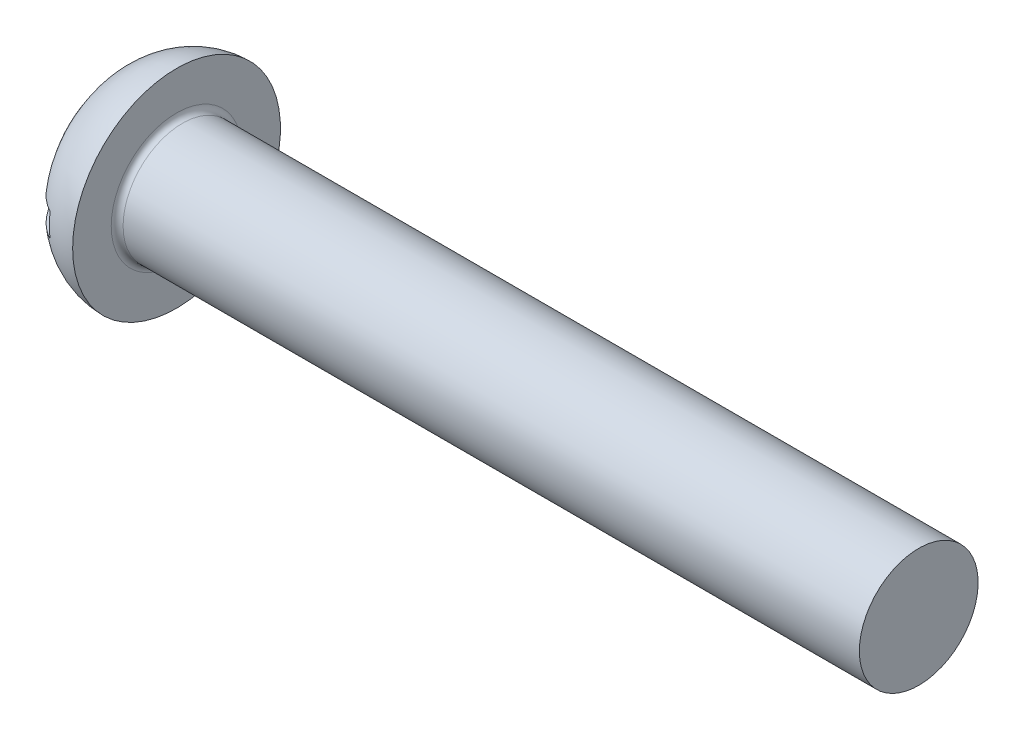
ISO-10303-21;
HEADER;
FILE_DESCRIPTION(('STEP AP214'),'2;1');
FILE_NAME('part.step','',(''),(''),'','','');
FILE_SCHEMA(('AUTOMOTIVE_DESIGN { 1 0 10303 214 1 1 1 1 }'));
ENDSEC;
DATA;
#1=APPLICATION_CONTEXT('core data for automotive mechanical design processes');
#2=APPLICATION_PROTOCOL_DEFINITION('international standard','automotive_design',2000,#1);
#3=PRODUCT_CONTEXT('',#1,'mechanical');
#4=PRODUCT('Part','Part','',(#3));
#5=PRODUCT_RELATED_PRODUCT_CATEGORY('part','',(#4));
#6=PRODUCT_DEFINITION_FORMATION('','',#4);
#7=PRODUCT_DEFINITION_CONTEXT('part definition',#1,'design');
#8=PRODUCT_DEFINITION('design','',#6,#7);
#9=PRODUCT_DEFINITION_SHAPE('','',#8);
#10=(LENGTH_UNIT() NAMED_UNIT(*) SI_UNIT(.MILLI.,.METRE.));
#11=(NAMED_UNIT(*) PLANE_ANGLE_UNIT() SI_UNIT($,.RADIAN.));
#12=(NAMED_UNIT(*) SI_UNIT($,.STERADIAN.) SOLID_ANGLE_UNIT());
#13=UNCERTAINTY_MEASURE_WITH_UNIT(LENGTH_MEASURE(1.E-05),#10,'distance_accuracy_value','');
#14=(GEOMETRIC_REPRESENTATION_CONTEXT(3) GLOBAL_UNCERTAINTY_ASSIGNED_CONTEXT((#13)) GLOBAL_UNIT_ASSIGNED_CONTEXT((#10,
#11,#12)) REPRESENTATION_CONTEXT('',''));
#15=CARTESIAN_POINT('',(0.,0.,0.));
#16=DIRECTION('',(0.,0.,1.));
#17=DIRECTION('',(1.,0.,0.));
#18=AXIS2_PLACEMENT_3D('',#15,#16,#17);
#19=CARTESIAN_POINT('',(8.4,0.,0.));
#20=DIRECTION('',(-1.,0.,0.));
#21=DIRECTION('',(0.,1.,0.));
#22=AXIS2_PLACEMENT_3D('',#19,#20,#21);
#23=SPHERICAL_SURFACE('',#22,8.4);
#24=CARTESIAN_POINT('',(8.4,0.8,0.));
#25=DIRECTION('',(0.,-1.,0.));
#26=DIRECTION('',(0.,0.,-1.));
#27=AXIS2_PLACEMENT_3D('',#24,#25,#26);
#28=CIRCLE('',#27,8.36181798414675);
#29=CARTESIAN_POINT('',(1.88795521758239,0.799999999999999,5.24530959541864));
#30=VERTEX_POINT('',#29);
#31=CARTESIAN_POINT('',(1.88795521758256,0.800000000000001,-5.24530959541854));
#32=VERTEX_POINT('',#31);
#33=EDGE_CURVE('E61',#30,#32,#28,.T.);
#34=ORIENTED_EDGE('',*,*,#33,.F.);
#35=CARTESIAN_POINT('',(1.88795521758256,0.,0.));
#36=DIRECTION('',(-1.,0.,0.));
#37=DIRECTION('',(0.,0.,1.));
#38=AXIS2_PLACEMENT_3D('',#35,#36,#37);
#39=CIRCLE('',#38,5.30596576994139);
#40=EDGE_CURVE('E110',#30,#32,#39,.T.);
#41=ORIENTED_EDGE('',*,*,#40,.T.);
#42=EDGE_LOOP('',(#34,#41));
#43=FACE_BOUND('',#42,.T.);
#44=ADVANCED_FACE('F33',(#43),#23,.T.);
#45=CARTESIAN_POINT('',(8.4,-0.8,0.));
#46=DIRECTION('',(0.,1.,0.));
#47=DIRECTION('',(0.,0.,1.));
#48=AXIS2_PLACEMENT_3D('',#45,#46,#47);
#49=CIRCLE('',#48,8.36181798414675);
#50=CARTESIAN_POINT('',(1.88795521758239,-0.799999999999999,-5.24530959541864));
#51=VERTEX_POINT('',#50);
#52=CARTESIAN_POINT('',(1.88795521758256,-0.800000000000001,5.24530959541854));
#53=VERTEX_POINT('',#52);
#54=EDGE_CURVE('E114',#51,#53,#49,.T.);
#55=ORIENTED_EDGE('',*,*,#54,.F.);
#56=EDGE_CURVE('E112',#51,#53,#39,.T.);
#57=ORIENTED_EDGE('',*,*,#56,.T.);
#58=EDGE_LOOP('',(#55,#57));
#59=FACE_BOUND('',#58,.T.);
#60=ADVANCED_FACE('F123',(#59),#23,.T.);
#61=CARTESIAN_POINT('',(5.45407497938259,0.,0.));
#62=DIRECTION('',(-1.,0.,0.));
#63=DIRECTION('',(0.,0.,1.));
#64=AXIS2_PLACEMENT_3D('',#61,#62,#63);
#65=DEGENERATE_TOROIDAL_SURFACE('',#64,2.40031784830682,4.6,.T.);
#66=CARTESIAN_POINT('',(5.4,0.,0.));
#67=DIRECTION('',(-1.,0.,0.));
#68=DIRECTION('',(0.,0.,1.));
#69=AXIS2_PLACEMENT_3D('',#66,#67,#68);
#70=CIRCLE('',#69,7.);
#71=CARTESIAN_POINT('',(5.4,0.,7.));
#72=VERTEX_POINT('',#71);
#73=EDGE_CURVE('E107',#72,#72,#70,.T.);
#74=ORIENTED_EDGE('',*,*,#73,.T.);
#75=EDGE_LOOP('',(#74));
#76=FACE_BOUND('',#75,.T.);
#77=CARTESIAN_POINT('',(1.1414211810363,0.8,0.));
#78=CARTESIAN_POINT('',(1.14142220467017,0.8,-0.0345172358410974));
#79=CARTESIAN_POINT('',(1.14058590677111,0.8,-0.0690333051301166));
#80=CARTESIAN_POINT('',(1.13731880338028,0.8,-0.137991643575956));
#81=CARTESIAN_POINT('',(1.13488783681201,0.8,-0.17243390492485));
#82=CARTESIAN_POINT('',(1.12547534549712,0.8,-0.275657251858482));
#83=CARTESIAN_POINT('',(1.11637508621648,0.8,-0.344241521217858));
#84=CARTESIAN_POINT('',(1.09464411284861,0.8,-0.481797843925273));
#85=CARTESIAN_POINT('',(1.08196499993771,0.8,-0.550761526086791));
#86=CARTESIAN_POINT('',(1.05527415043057,0.8,-0.688408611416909));
#87=CARTESIAN_POINT('',(1.04126264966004,0.8,-0.757092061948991));
#88=CARTESIAN_POINT('',(1.00795994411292,0.8,-0.921280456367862));
#89=CARTESIAN_POINT('',(0.98874039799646,0.8,-1.01680095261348));
#90=CARTESIAN_POINT('',(0.95299632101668,0.8,-1.20835194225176));
#91=CARTESIAN_POINT('',(0.936471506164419,0.8,-1.30438238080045));
#92=CARTESIAN_POINT('',(0.907414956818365,0.8,-1.49700901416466));
#93=CARTESIAN_POINT('',(0.894881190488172,0.8,-1.59360489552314));
#94=CARTESIAN_POINT('',(0.874565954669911,0.8,-1.78730516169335));
#95=CARTESIAN_POINT('',(0.866784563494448,0.8,-1.88440955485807));
#96=CARTESIAN_POINT('',(0.856503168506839,0.8,-2.0778219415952));
#97=CARTESIAN_POINT('',(0.853945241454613,0.8,-2.17412674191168));
#98=CARTESIAN_POINT('',(0.854215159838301,0.8,-2.3667306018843));
#99=CARTESIAN_POINT('',(0.857043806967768,0.8,-2.46302965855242));
#100=CARTESIAN_POINT('',(0.873909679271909,0.8,-2.75152005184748));
#101=CARTESIAN_POINT('',(0.89632586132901,0.8,-2.94332157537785));
#102=CARTESIAN_POINT('',(0.953231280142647,0.8,-3.26229651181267));
#103=CARTESIAN_POINT('',(0.981605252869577,0.8,-3.39060582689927));
#104=CARTESIAN_POINT('',(1.04890085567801,0.8,-3.64438520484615));
#105=CARTESIAN_POINT('',(1.0878172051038,0.8,-3.76985665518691));
#106=CARTESIAN_POINT('',(1.17624520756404,0.8,-4.01767627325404));
#107=CARTESIAN_POINT('',(1.22580616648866,0.800000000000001,-4.14000683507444));
#108=CARTESIAN_POINT('',(1.33514658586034,0.800000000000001,-4.38006871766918));
#109=CARTESIAN_POINT('',(1.39492966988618,0.800000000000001,-4.49779838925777));
#110=CARTESIAN_POINT('',(1.52425463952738,0.800000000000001,-4.72762054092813));
#111=CARTESIAN_POINT('',(1.59378701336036,0.800000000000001,-4.83971837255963));
#112=CARTESIAN_POINT('',(1.7422088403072,0.800000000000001,-5.05760119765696));
#113=CARTESIAN_POINT('',(1.82110178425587,0.800000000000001,-5.16338381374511));
#114=CARTESIAN_POINT('',(1.9874991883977,0.800000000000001,-5.36758736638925));
#115=CARTESIAN_POINT('',(2.07498586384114,0.800000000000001,-5.4660227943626));
#116=CARTESIAN_POINT('',(2.25811233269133,0.800000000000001,-5.65506451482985));
#117=CARTESIAN_POINT('',(2.35375509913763,0.800000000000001,-5.7456679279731));
#118=CARTESIAN_POINT('',(2.55091605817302,0.800000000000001,-5.91697146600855));
#119=CARTESIAN_POINT('',(2.65231898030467,0.800000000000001,-5.99780430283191));
#120=CARTESIAN_POINT('',(2.86164423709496,0.800000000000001,-6.15062175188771));
#121=CARTESIAN_POINT('',(2.96956894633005,0.800000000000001,-6.22260311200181));
#122=CARTESIAN_POINT('',(3.19114431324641,0.800000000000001,-6.35716245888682));
#123=CARTESIAN_POINT('',(3.30479552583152,0.800000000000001,-6.41973953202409));
#124=CARTESIAN_POINT('',(3.53703911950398,0.800000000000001,-6.53504510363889));
#125=CARTESIAN_POINT('',(3.65563330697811,0.800000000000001,-6.58776996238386));
#126=CARTESIAN_POINT('',(3.89606794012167,0.800000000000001,-6.68263576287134));
#127=CARTESIAN_POINT('',(4.01788117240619,0.800000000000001,-6.72484553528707));
#128=CARTESIAN_POINT('',(4.26464895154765,0.800000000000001,-6.79884641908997));
#129=CARTESIAN_POINT('',(4.38960465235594,0.800000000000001,-6.83063364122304));
#130=CARTESIAN_POINT('',(4.7676834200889,0.800000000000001,-6.90992859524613));
#131=CARTESIAN_POINT('',(5.02433636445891,0.800000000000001,-6.94149481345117));
#132=CARTESIAN_POINT('',(5.53871383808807,0.800000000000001,-6.96089852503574));
#133=CARTESIAN_POINT('',(5.79643469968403,0.800000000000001,-6.9488334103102));
#134=CARTESIAN_POINT('',(6.17859025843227,0.800000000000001,-6.89849673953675));
#135=CARTESIAN_POINT('',(6.30532659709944,0.800000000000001,-6.87631734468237));
#136=CARTESIAN_POINT('',(6.55646479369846,0.800000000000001,-6.82136563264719));
#137=CARTESIAN_POINT('',(6.68086750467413,0.800000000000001,-6.7885972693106));
#138=CARTESIAN_POINT('',(6.92652500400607,0.800000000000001,-6.71268050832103));
#139=CARTESIAN_POINT('',(7.0477781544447,0.800000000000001,-6.66952682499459));
#140=CARTESIAN_POINT('',(7.28617708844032,0.800000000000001,-6.57317768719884));
#141=CARTESIAN_POINT('',(7.40332436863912,0.800000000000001,-6.51998593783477));
#142=CARTESIAN_POINT('',(7.63263944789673,0.800000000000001,-6.40397756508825));
#143=CARTESIAN_POINT('',(7.74481096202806,0.800000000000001,-6.34116828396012));
#144=CARTESIAN_POINT('',(7.9634398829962,0.800000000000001,-6.20637177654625));
#145=CARTESIAN_POINT('',(8.06989936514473,0.800000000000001,-6.13438791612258));
#146=CARTESIAN_POINT('',(8.27647595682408,0.800000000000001,-5.98168659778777));
#147=CARTESIAN_POINT('',(8.37658849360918,0.800000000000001,-5.9009629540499));
#148=CARTESIAN_POINT('',(8.56965531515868,0.800000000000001,-5.73143476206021));
#149=CARTESIAN_POINT('',(8.66261217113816,0.800000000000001,-5.64263314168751));
#150=CARTESIAN_POINT('',(8.84109763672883,0.800000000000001,-5.45721575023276));
#151=CARTESIAN_POINT('',(8.9265973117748,0.800000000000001,-5.36057212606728));
#152=CARTESIAN_POINT('',(9.0891622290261,0.800000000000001,-5.16049245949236));
#153=CARTESIAN_POINT('',(9.1662304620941,0.800000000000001,-5.05705884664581));
#154=CARTESIAN_POINT('',(9.31196915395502,0.800000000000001,-4.84334875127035));
#155=CARTESIAN_POINT('',(9.38057559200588,0.800000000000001,-4.73302860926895));
#156=CARTESIAN_POINT('',(9.50826632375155,0.800000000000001,-4.50706266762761));
#157=CARTESIAN_POINT('',(9.56735401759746,0.800000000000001,-4.39141878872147));
#158=CARTESIAN_POINT('',(9.67523473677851,0.800000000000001,-4.1565465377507));
#159=CARTESIAN_POINT('',(9.7241063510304,0.8,-4.03735425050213));
#160=CARTESIAN_POINT('',(9.81188317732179,0.8,-3.79533794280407));
#161=CARTESIAN_POINT('',(9.85078664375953,0.8,-3.67251329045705));
#162=CARTESIAN_POINT('',(9.91883944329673,0.8,-3.4226544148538));
#163=CARTESIAN_POINT('',(9.94787114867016,0.800000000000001,-3.29558798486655));
#164=CARTESIAN_POINT('',(9.98358746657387,0.8,-3.10359020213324));
#165=CARTESIAN_POINT('',(9.99418728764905,0.8,-3.03936191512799));
#166=CARTESIAN_POINT('',(10.012790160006,0.8,-2.9105376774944));
#167=CARTESIAN_POINT('',(10.0207936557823,0.8,-2.84594179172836));
#168=CARTESIAN_POINT('',(10.0342920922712,0.8,-2.71581972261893));
#169=CARTESIAN_POINT('',(10.0397604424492,0.8,-2.65029079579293));
#170=CARTESIAN_POINT('',(10.0481017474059,0.8,-2.51903446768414));
#171=CARTESIAN_POINT('',(10.050973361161,0.8,-2.45330698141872));
#172=CARTESIAN_POINT('',(10.054166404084,0.8,-2.32172327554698));
#173=CARTESIAN_POINT('',(10.0544852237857,0.8,-2.2558669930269));
#174=CARTESIAN_POINT('',(10.0526385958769,0.8,-2.12428463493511));
#175=CARTESIAN_POINT('',(10.0504766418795,0.8,-2.05855850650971));
#176=CARTESIAN_POINT('',(10.0415736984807,0.8,-1.88436421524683));
#177=CARTESIAN_POINT('',(10.0327650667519,0.8,-1.77599721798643));
#178=CARTESIAN_POINT('',(10.0092811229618,0.8,-1.55989585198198));
#179=CARTESIAN_POINT('',(9.99460442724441,0.8,-1.45216163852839));
#180=CARTESIAN_POINT('',(9.96046725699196,0.8,-1.23722688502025));
#181=CARTESIAN_POINT('',(9.94099607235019,0.8,-1.13002809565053));
#182=CARTESIAN_POINT('',(9.9098187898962,0.8,-0.969497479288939));
#183=CARTESIAN_POINT('',(9.89908393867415,0.8,-0.91596808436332));
#184=CARTESIAN_POINT('',(9.87742289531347,0.8,-0.8089477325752));
#185=CARTESIAN_POINT('',(9.86649670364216,0.8,-0.755456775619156));
#186=CARTESIAN_POINT('',(9.84488810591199,0.8,-0.647513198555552));
#187=CARTESIAN_POINT('',(9.83421261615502,0.8,-0.593059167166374));
#188=CARTESIAN_POINT('',(9.81418327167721,0.8,-0.483892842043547));
#189=CARTESIAN_POINT('',(9.80482958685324,0.8,-0.429180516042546));
#190=CARTESIAN_POINT('',(9.78862226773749,0.8,-0.31967429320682));
#191=CARTESIAN_POINT('',(9.78175525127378,0.8,-0.264882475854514));
#192=CARTESIAN_POINT('',(9.77161076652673,0.8,-0.154977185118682));
#193=CARTESIAN_POINT('',(9.76833123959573,0.8,-0.0998639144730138));
#194=CARTESIAN_POINT('',(9.76605323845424,0.8,0.0104032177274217));
#195=CARTESIAN_POINT('',(9.76705053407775,0.8,0.0655569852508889));
#196=CARTESIAN_POINT('',(9.77309436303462,0.8,0.175651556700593));
#197=CARTESIAN_POINT('',(9.77814277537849,0.8,0.23059224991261));
#198=CARTESIAN_POINT('',(9.79134400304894,0.8,0.340370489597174));
#199=CARTESIAN_POINT('',(9.79951300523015,0.8,0.395205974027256));
#200=CARTESIAN_POINT('',(9.81775686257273,0.8,0.504546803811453));
#201=CARTESIAN_POINT('',(9.82783176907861,0.8,0.559052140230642));
#202=CARTESIAN_POINT('',(9.84818728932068,0.8,0.66439658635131));
#203=CARTESIAN_POINT('',(9.85841323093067,0.8,0.71524654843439));
#204=CARTESIAN_POINT('',(9.87900675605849,0.8,0.816918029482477));
#205=CARTESIAN_POINT('',(9.88937434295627,0.8,0.867739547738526));
#206=CARTESIAN_POINT('',(9.91990805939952,0.8,1.02006935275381));
#207=CARTESIAN_POINT('',(9.93955745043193,0.8,1.12168653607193));
#208=CARTESIAN_POINT('',(9.97515822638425,0.8,1.32571133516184));
#209=CARTESIAN_POINT('',(9.99110524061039,0.8,1.42811973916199));
#210=CARTESIAN_POINT('',(10.0180507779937,0.8,1.63367350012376));
#211=CARTESIAN_POINT('',(10.0290458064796,0.8,1.73681932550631));
#212=CARTESIAN_POINT('',(10.0452539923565,0.8,1.94250236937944));
#213=CARTESIAN_POINT('',(10.0505256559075,0.8,2.0450348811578));
#214=CARTESIAN_POINT('',(10.0550636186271,0.8,2.25022669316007));
#215=CARTESIAN_POINT('',(10.0543306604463,0.8,2.3528859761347));
#216=CARTESIAN_POINT('',(10.0465955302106,0.8,2.55819303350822));
#217=CARTESIAN_POINT('',(10.0395798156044,0.8,2.66084030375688));
#218=CARTESIAN_POINT('',(10.0191141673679,0.8,2.86548837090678));
#219=CARTESIAN_POINT('',(10.0056649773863,0.8,2.96748924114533));
#220=CARTESIAN_POINT('',(9.97832872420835,0.8,3.13361504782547));
#221=CARTESIAN_POINT('',(9.96636863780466,0.8,3.19806312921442));
#222=CARTESIAN_POINT('',(9.93982211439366,0.8,3.32634764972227));
#223=CARTESIAN_POINT('',(9.92523845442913,0.8,3.39018466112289));
#224=CARTESIAN_POINT('',(9.89333298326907,0.8,3.51763773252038));
#225=CARTESIAN_POINT('',(9.87599305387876,0.8,3.58124926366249));
#226=CARTESIAN_POINT('',(9.83865961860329,0.8,3.70770633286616));
#227=CARTESIAN_POINT('',(9.81866527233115,0.8,3.7705516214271));
#228=CARTESIAN_POINT('',(9.75490511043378,0.8,3.95724735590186));
#229=CARTESIAN_POINT('',(9.70722914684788,0.799999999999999,4.07978942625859));
#230=CARTESIAN_POINT('',(9.60184009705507,0.799999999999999,4.32009491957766));
#231=CARTESIAN_POINT('',(9.54415244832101,0.799999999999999,4.43786954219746));
#232=CARTESIAN_POINT('',(9.41893181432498,0.799999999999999,4.66827107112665));
#233=CARTESIAN_POINT('',(9.35138598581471,0.799999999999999,4.78089100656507));
#234=CARTESIAN_POINT('',(9.20689656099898,0.799999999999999,5.00007205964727));
#235=CARTESIAN_POINT('',(9.12994484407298,0.799999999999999,5.10662782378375));
#236=CARTESIAN_POINT('',(8.96703015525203,0.799999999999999,5.31302810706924));
#237=CARTESIAN_POINT('',(8.8810460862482,0.799999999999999,5.41285597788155));
#238=CARTESIAN_POINT('',(8.70085837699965,0.799999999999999,5.60474321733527));
#239=CARTESIAN_POINT('',(8.60665708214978,0.799999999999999,5.69680478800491));
#240=CARTESIAN_POINT('',(8.41208213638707,0.799999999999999,5.8712562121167));
#241=CARTESIAN_POINT('',(8.31181449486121,0.799999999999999,5.95376433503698));
#242=CARTESIAN_POINT('',(8.10460702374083,0.799999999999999,6.11001288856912));
#243=CARTESIAN_POINT('',(7.99766476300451,0.799999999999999,6.1837500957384));
#244=CARTESIAN_POINT('',(7.77808611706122,0.799999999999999,6.32176772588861));
#245=CARTESIAN_POINT('',(7.66545929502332,0.799999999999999,6.38606336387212));
#246=CARTESIAN_POINT('',(7.43511543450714,0.799999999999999,6.50489269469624));
#247=CARTESIAN_POINT('',(7.31739654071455,0.799999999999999,6.55942279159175));
#248=CARTESIAN_POINT('',(7.07853076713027,0.799999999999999,6.65797210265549));
#249=CARTESIAN_POINT('',(6.95741101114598,0.799999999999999,6.70205707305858));
#250=CARTESIAN_POINT('',(6.7118378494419,0.799999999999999,6.77986361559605));
#251=CARTESIAN_POINT('',(6.58738323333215,0.799999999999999,6.81358136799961));
#252=CARTESIAN_POINT('',(6.33606687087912,0.799999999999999,6.87038819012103));
#253=CARTESIAN_POINT('',(6.20920503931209,0.799999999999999,6.89347688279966));
#254=CARTESIAN_POINT('',(5.9539372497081,0.799999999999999,6.92886314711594));
#255=CARTESIAN_POINT('',(5.82553073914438,0.799999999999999,6.94115673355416));
#256=CARTESIAN_POINT('',(5.56849852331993,0.799999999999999,6.95483001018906));
#257=CARTESIAN_POINT('',(5.43987443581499,0.799999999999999,6.95624013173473));
#258=CARTESIAN_POINT('',(5.18291759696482,0.799999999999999,6.94821491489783));
#259=CARTESIAN_POINT('',(5.05458496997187,0.799999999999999,6.93877559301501));
#260=CARTESIAN_POINT('',(4.79923385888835,0.799999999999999,6.90912024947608));
#261=CARTESIAN_POINT('',(4.67221477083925,0.799999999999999,6.88890942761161));
#262=CARTESIAN_POINT('',(4.42028670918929,0.799999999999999,6.83785109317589));
#263=CARTESIAN_POINT('',(4.2953784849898,0.799999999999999,6.80699988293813));
#264=CARTESIAN_POINT('',(4.04866021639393,0.799999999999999,6.73490083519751));
#265=CARTESIAN_POINT('',(3.92684881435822,0.799999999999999,6.69365764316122));
#266=CARTESIAN_POINT('',(3.68712964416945,0.799999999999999,6.60106481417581));
#267=CARTESIAN_POINT('',(3.56922188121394,0.799999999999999,6.54971516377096));
#268=CARTESIAN_POINT('',(3.33812166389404,0.799999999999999,6.43726817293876));
#269=CARTESIAN_POINT('',(3.22493013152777,0.799999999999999,6.37616893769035));
#270=CARTESIAN_POINT('',(3.00412337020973,0.799999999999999,6.24469246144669));
#271=CARTESIAN_POINT('',(2.89650623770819,0.799999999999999,6.17431841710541));
#272=CARTESIAN_POINT('',(2.68738013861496,0.799999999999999,6.02465176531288));
#273=CARTESIAN_POINT('',(2.58588211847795,0.799999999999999,5.94534386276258));
#274=CARTESIAN_POINT('',(2.38994454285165,0.799999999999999,5.77851091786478));
#275=CARTESIAN_POINT('',(2.29550244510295,0.799999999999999,5.6909888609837));
#276=CARTESIAN_POINT('',(2.11426291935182,0.799999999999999,5.50830388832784));
#277=CARTESIAN_POINT('',(2.02746791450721,0.799999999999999,5.41313856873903));
#278=CARTESIAN_POINT('',(1.86218144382,0.799999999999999,5.21591052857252));
#279=CARTESIAN_POINT('',(1.783687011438,0.799999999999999,5.11385029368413));
#280=CARTESIAN_POINT('',(1.63516642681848,0.799999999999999,4.90306738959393));
#281=CARTESIAN_POINT('',(1.56517925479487,0.799999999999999,4.79431725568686));
#282=CARTESIAN_POINT('',(1.43456384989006,0.799999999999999,4.57138785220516));
#283=CARTESIAN_POINT('',(1.3739323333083,0.799999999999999,4.45721050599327));
#284=CARTESIAN_POINT('',(1.26234103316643,0.799999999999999,4.22413042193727));
#285=CARTESIAN_POINT('',(1.21138778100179,0.799999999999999,4.10522455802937));
#286=CARTESIAN_POINT('',(1.11951064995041,0.799999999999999,3.86364774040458));
#287=CARTESIAN_POINT('',(1.0785834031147,0.8,3.74097806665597));
#288=CARTESIAN_POINT('',(1.00645065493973,0.8,3.49104864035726));
#289=CARTESIAN_POINT('',(0.975381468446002,0.8,3.36374956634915));
#290=CARTESIAN_POINT('',(0.923799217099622,0.8,3.10707606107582));
#291=CARTESIAN_POINT('',(0.903282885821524,0.8,2.97770228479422));
#292=CARTESIAN_POINT('',(0.872748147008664,0.8,2.71799781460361));
#293=CARTESIAN_POINT('',(0.862708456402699,0.8,2.58766960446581));
#294=CARTESIAN_POINT('',(0.85278814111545,0.8,2.32665454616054));
#295=CARTESIAN_POINT('',(0.852905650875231,0.8,2.19596776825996));
#296=CARTESIAN_POINT('',(0.86106380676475,0.8,1.97888780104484));
#297=CARTESIAN_POINT('',(0.86642630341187,0.8,1.89238073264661));
#298=CARTESIAN_POINT('',(0.881078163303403,0.8,1.71970698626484));
#299=CARTESIAN_POINT('',(0.890367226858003,0.8,1.6335402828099));
#300=CARTESIAN_POINT('',(0.912496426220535,0.8,1.46123638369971));
#301=CARTESIAN_POINT('',(0.925354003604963,0.8,1.37510146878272));
#302=CARTESIAN_POINT('',(0.953906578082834,0.8,1.20333321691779));
#303=CARTESIAN_POINT('',(0.969600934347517,0.8,1.11769977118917));
#304=CARTESIAN_POINT('',(1.00282340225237,0.8,0.946118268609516));
#305=CARTESIAN_POINT('',(1.02036462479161,0.8,0.860172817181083));
#306=CARTESIAN_POINT('',(1.05524126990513,0.8,0.688152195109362));
#307=CARTESIAN_POINT('',(1.07257645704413,0.8,0.60207698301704));
#308=CARTESIAN_POINT('',(1.1034124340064,0.8,0.430378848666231));
#309=CARTESIAN_POINT('',(1.11696266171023,0.8,0.344765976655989));
#310=CARTESIAN_POINT('',(1.13126679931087,0.8,0.215740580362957));
#311=CARTESIAN_POINT('',(1.13503048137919,0.8,0.172678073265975));
#312=CARTESIAN_POINT('',(1.14010681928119,0.8,0.0864097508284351));
#313=CARTESIAN_POINT('',(1.14141989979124,0.8,0.0432039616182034));
#314=CARTESIAN_POINT('',(1.1414211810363,0.8,0.));
#315=B_SPLINE_CURVE_WITH_KNOTS('',3,(#77,#78,#79,#80,#81,#82,#83,#84,#85,#86,#87,#88,#89,#90,
#91,#92,#93,#94,#95,#96,#97,#98,#99,#100,#101,#102,#103,#104,#105,#106,#107,#108,#109,#110,#111,
#112,#113,#114,#115,#116,#117,#118,#119,#120,#121,#122,#123,#124,#125,#126,#127,#128,#129,#130,
#131,#132,#133,#134,#135,#136,#137,#138,#139,#140,#141,#142,#143,#144,#145,#146,#147,#148,#149,
#150,#151,#152,#153,#154,#155,#156,#157,#158,#159,#160,#161,#162,#163,#164,#165,#166,#167,#168,
#169,#170,#171,#172,#173,#174,#175,#176,#177,#178,#179,#180,#181,#182,#183,#184,#185,#186,#187,
#188,#189,#190,#191,#192,#193,#194,#195,#196,#197,#198,#199,#200,#201,#202,#203,#204,#205,#206,
#207,#208,#209,#210,#211,#212,#213,#214,#215,#216,#217,#218,#219,#220,#221,#222,#223,#224,#225,
#226,#227,#228,#229,#230,#231,#232,#233,#234,#235,#236,#237,#238,#239,#240,#241,#242,#243,#244,
#245,#246,#247,#248,#249,#250,#251,#252,#253,#254,#255,#256,#257,#258,#259,#260,#261,#262,#263,
#264,#265,#266,#267,#268,#269,#270,#271,#272,#273,#274,#275,#276,#277,#278,#279,#280,#281,#282,
#283,#284,#285,#286,#287,#288,#289,#290,#291,#292,#293,#294,#295,#296,#297,#298,#299,#300,#301,
#302,#303,#304,#305,#306,#307,#308,#309,#310,#311,#312,#313,#314),.UNSPECIFIED.,.T.,.F.,(4,2,2,
2,2,2,2,2,2,2,2,2,2,2,2,2,2,2,2,2,2,2,2,2,2,2,2,2,2,2,2,2,2,2,2,2,2,2,2,2,2,2,2,2,2,2,2,2,2,2,2,
2,2,2,2,2,2,2,2,2,2,2,2,2,2,2,2,2,2,2,2,2,2,2,2,2,2,2,2,2,2,2,2,2,2,2,2,2,2,2,2,2,2,2,2,2,2,2,2,
2,2,2,2,2,2,2,2,2,2,2,2,2,2,2,2,2,2,2,4),(0.,0.103540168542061,0.207090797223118,
0.414471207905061,0.624802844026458,0.835097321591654,1.12739152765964,1.41965490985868,
1.7117692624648,2.00388842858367,2.29275028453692,2.5816551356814,3.1594141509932,
3.55324357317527,3.94687609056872,4.34237282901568,4.73801005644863,5.13326393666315,
5.52866568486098,5.92326572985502,6.31801023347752,6.70658166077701,7.09529542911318,
7.48404693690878,7.8729417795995,8.25921979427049,8.6456417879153,9.41747302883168,
10.187582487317,10.5731874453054,10.9586485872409,11.3443063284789,11.729821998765,
12.1150448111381,12.5001267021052,12.8854829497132,13.270700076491,13.6573509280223,
14.0438641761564,14.4331424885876,14.822281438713,15.2083067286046,15.5943995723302,
15.9849437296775,16.1801917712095,16.3754063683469,16.572624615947,16.7699446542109,
16.9674663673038,17.1647102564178,17.4906880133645,17.8167426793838,18.1435324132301,
18.3073190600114,18.4711053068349,18.6375720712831,18.8040602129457,18.969638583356,
19.1351218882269,19.3004415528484,19.4658379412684,19.6321041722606,19.7983748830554,
19.9539776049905,20.1095840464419,20.4200493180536,20.7308792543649,21.0419282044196,
21.3497666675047,21.6575670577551,21.966032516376,22.2744623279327,22.4710578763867,
22.6674465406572,22.865184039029,23.0629842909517,23.4569455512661,23.8499201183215,
24.2434113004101,24.6372446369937,25.0320192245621,25.4266815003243,25.8157678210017,
26.2049966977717,26.5935912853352,26.982328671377,27.3685495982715,27.7549126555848,
28.141289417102,28.527808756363,28.913246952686,29.2988267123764,29.6842205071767,
30.069748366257,30.4551041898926,30.8404605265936,31.2258918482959,31.6111906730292,
31.9971594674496,32.3829885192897,32.7689393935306,33.1547518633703,33.5422703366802,
33.9296524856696,34.3172951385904,34.7048073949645,35.0974655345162,35.4900020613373,
35.8817395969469,36.2734051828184,36.5333385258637,36.7932520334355,37.0544589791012,
37.3156069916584,37.5787529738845,37.8421752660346,38.1019761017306,38.2315960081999,
38.3611934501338),.UNSPECIFIED.);
#316=CARTESIAN_POINT('',(3.3,0.800000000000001,-6.41510349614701));
#317=VERTEX_POINT('',#316);
#318=EDGE_CURVE('E11',#32,#317,#315,.T.);
#319=ORIENTED_EDGE('',*,*,#318,.F.);
#320=ORIENTED_EDGE('',*,*,#40,.F.);
#321=CARTESIAN_POINT('',(3.3,0.799999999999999,6.41510349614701));
#322=VERTEX_POINT('',#321);
#323=EDGE_CURVE('E37',#322,#30,#315,.T.);
#324=ORIENTED_EDGE('',*,*,#323,.F.);
#325=CARTESIAN_POINT('',(3.3,0.,0.));
#326=DIRECTION('',(-1.,0.,0.));
#327=DIRECTION('',(0.,0.,1.));
#328=AXIS2_PLACEMENT_3D('',#325,#326,#327);
#329=CIRCLE('',#328,6.46479333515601);
#330=CARTESIAN_POINT('',(3.3,-0.800000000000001,6.415103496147));
#331=VERTEX_POINT('',#330);
#332=EDGE_CURVE('E88',#331,#322,#329,.T.);
#333=ORIENTED_EDGE('',*,*,#332,.F.);
#334=CARTESIAN_POINT('',(1.1414211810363,-0.8,0.));
#335=CARTESIAN_POINT('',(1.14142220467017,-0.8,0.0345172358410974));
#336=CARTESIAN_POINT('',(1.14058590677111,-0.8,0.0690333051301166));
#337=CARTESIAN_POINT('',(1.13731880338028,-0.8,0.137991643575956));
#338=CARTESIAN_POINT('',(1.13488783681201,-0.8,0.17243390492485));
#339=CARTESIAN_POINT('',(1.12547534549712,-0.8,0.275657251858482));
#340=CARTESIAN_POINT('',(1.11637508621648,-0.8,0.344241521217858));
#341=CARTESIAN_POINT('',(1.09464411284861,-0.8,0.481797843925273));
#342=CARTESIAN_POINT('',(1.08196499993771,-0.8,0.550761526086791));
#343=CARTESIAN_POINT('',(1.05527415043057,-0.8,0.688408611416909));
#344=CARTESIAN_POINT('',(1.04126264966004,-0.8,0.757092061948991));
#345=CARTESIAN_POINT('',(1.00795994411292,-0.8,0.921280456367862));
#346=CARTESIAN_POINT('',(0.98874039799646,-0.8,1.01680095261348));
#347=CARTESIAN_POINT('',(0.95299632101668,-0.8,1.20835194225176));
#348=CARTESIAN_POINT('',(0.936471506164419,-0.8,1.30438238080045));
#349=CARTESIAN_POINT('',(0.907414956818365,-0.8,1.49700901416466));
#350=CARTESIAN_POINT('',(0.894881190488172,-0.8,1.59360489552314));
#351=CARTESIAN_POINT('',(0.874565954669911,-0.8,1.78730516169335));
#352=CARTESIAN_POINT('',(0.866784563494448,-0.8,1.88440955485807));
#353=CARTESIAN_POINT('',(0.856503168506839,-0.8,2.0778219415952));
#354=CARTESIAN_POINT('',(0.853945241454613,-0.8,2.17412674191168));
#355=CARTESIAN_POINT('',(0.854215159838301,-0.8,2.3667306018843));
#356=CARTESIAN_POINT('',(0.857043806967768,-0.8,2.46302965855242));
#357=CARTESIAN_POINT('',(0.873909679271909,-0.8,2.75152005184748));
#358=CARTESIAN_POINT('',(0.89632586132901,-0.8,2.94332157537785));
#359=CARTESIAN_POINT('',(0.953231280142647,-0.8,3.26229651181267));
#360=CARTESIAN_POINT('',(0.981605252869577,-0.8,3.39060582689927));
#361=CARTESIAN_POINT('',(1.04890085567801,-0.8,3.64438520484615));
#362=CARTESIAN_POINT('',(1.0878172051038,-0.8,3.76985665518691));
#363=CARTESIAN_POINT('',(1.17624520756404,-0.8,4.01767627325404));
#364=CARTESIAN_POINT('',(1.22580616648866,-0.800000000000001,4.14000683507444));
#365=CARTESIAN_POINT('',(1.33514658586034,-0.800000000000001,4.38006871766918));
#366=CARTESIAN_POINT('',(1.39492966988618,-0.800000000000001,4.49779838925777));
#367=CARTESIAN_POINT('',(1.52425463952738,-0.800000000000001,4.72762054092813));
#368=CARTESIAN_POINT('',(1.59378701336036,-0.800000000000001,4.83971837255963));
#369=CARTESIAN_POINT('',(1.7422088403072,-0.800000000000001,5.05760119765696));
#370=CARTESIAN_POINT('',(1.82110178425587,-0.800000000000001,5.16338381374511));
#371=CARTESIAN_POINT('',(1.9874991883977,-0.800000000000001,5.36758736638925));
#372=CARTESIAN_POINT('',(2.07498586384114,-0.800000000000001,5.4660227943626));
#373=CARTESIAN_POINT('',(2.25811233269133,-0.800000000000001,5.65506451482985));
#374=CARTESIAN_POINT('',(2.35375509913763,-0.800000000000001,5.7456679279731));
#375=CARTESIAN_POINT('',(2.55091605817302,-0.800000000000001,5.91697146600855));
#376=CARTESIAN_POINT('',(2.65231898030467,-0.800000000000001,5.99780430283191));
#377=CARTESIAN_POINT('',(2.86164423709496,-0.800000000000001,6.15062175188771));
#378=CARTESIAN_POINT('',(2.96956894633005,-0.800000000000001,6.22260311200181));
#379=CARTESIAN_POINT('',(3.19114431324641,-0.800000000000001,6.35716245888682));
#380=CARTESIAN_POINT('',(3.30479552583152,-0.800000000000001,6.41973953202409));
#381=CARTESIAN_POINT('',(3.53703911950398,-0.800000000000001,6.53504510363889));
#382=CARTESIAN_POINT('',(3.65563330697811,-0.800000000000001,6.58776996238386));
#383=CARTESIAN_POINT('',(3.89606794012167,-0.800000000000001,6.68263576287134));
#384=CARTESIAN_POINT('',(4.01788117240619,-0.800000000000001,6.72484553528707));
#385=CARTESIAN_POINT('',(4.26464895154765,-0.800000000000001,6.79884641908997));
#386=CARTESIAN_POINT('',(4.38960465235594,-0.800000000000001,6.83063364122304));
#387=CARTESIAN_POINT('',(4.7676834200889,-0.800000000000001,6.90992859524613));
#388=CARTESIAN_POINT('',(5.02433636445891,-0.800000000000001,6.94149481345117));
#389=CARTESIAN_POINT('',(5.53871383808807,-0.800000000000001,6.96089852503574));
#390=CARTESIAN_POINT('',(5.79643469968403,-0.800000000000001,6.9488334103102));
#391=CARTESIAN_POINT('',(6.17859025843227,-0.800000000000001,6.89849673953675));
#392=CARTESIAN_POINT('',(6.30532659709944,-0.800000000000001,6.87631734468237));
#393=CARTESIAN_POINT('',(6.55646479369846,-0.800000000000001,6.82136563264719));
#394=CARTESIAN_POINT('',(6.68086750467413,-0.800000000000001,6.7885972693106));
#395=CARTESIAN_POINT('',(6.92652500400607,-0.800000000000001,6.71268050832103));
#396=CARTESIAN_POINT('',(7.0477781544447,-0.800000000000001,6.66952682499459));
#397=CARTESIAN_POINT('',(7.28617708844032,-0.800000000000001,6.57317768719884));
#398=CARTESIAN_POINT('',(7.40332436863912,-0.800000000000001,6.51998593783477));
#399=CARTESIAN_POINT('',(7.63263944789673,-0.800000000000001,6.40397756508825));
#400=CARTESIAN_POINT('',(7.74481096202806,-0.800000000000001,6.34116828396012));
#401=CARTESIAN_POINT('',(7.9634398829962,-0.800000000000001,6.20637177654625));
#402=CARTESIAN_POINT('',(8.06989936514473,-0.800000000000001,6.13438791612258));
#403=CARTESIAN_POINT('',(8.27647595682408,-0.800000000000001,5.98168659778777));
#404=CARTESIAN_POINT('',(8.37658849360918,-0.800000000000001,5.9009629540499));
#405=CARTESIAN_POINT('',(8.56965531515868,-0.800000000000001,5.73143476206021));
#406=CARTESIAN_POINT('',(8.66261217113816,-0.800000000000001,5.64263314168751));
#407=CARTESIAN_POINT('',(8.84109763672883,-0.800000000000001,5.45721575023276));
#408=CARTESIAN_POINT('',(8.9265973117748,-0.800000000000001,5.36057212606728));
#409=CARTESIAN_POINT('',(9.0891622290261,-0.800000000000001,5.16049245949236));
#410=CARTESIAN_POINT('',(9.1662304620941,-0.800000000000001,5.05705884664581));
#411=CARTESIAN_POINT('',(9.31196915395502,-0.800000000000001,4.84334875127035));
#412=CARTESIAN_POINT('',(9.38057559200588,-0.800000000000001,4.73302860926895));
#413=CARTESIAN_POINT('',(9.50826632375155,-0.800000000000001,4.50706266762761));
#414=CARTESIAN_POINT('',(9.56735401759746,-0.800000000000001,4.39141878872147));
#415=CARTESIAN_POINT('',(9.67523473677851,-0.800000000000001,4.1565465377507));
#416=CARTESIAN_POINT('',(9.7241063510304,-0.8,4.03735425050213));
#417=CARTESIAN_POINT('',(9.81188317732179,-0.8,3.79533794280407));
#418=CARTESIAN_POINT('',(9.85078664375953,-0.8,3.67251329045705));
#419=CARTESIAN_POINT('',(9.91883944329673,-0.8,3.4226544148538));
#420=CARTESIAN_POINT('',(9.94787114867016,-0.800000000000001,3.29558798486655));
#421=CARTESIAN_POINT('',(9.98358746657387,-0.8,3.10359020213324));
#422=CARTESIAN_POINT('',(9.99418728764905,-0.8,3.03936191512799));
#423=CARTESIAN_POINT('',(10.012790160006,-0.8,2.9105376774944));
#424=CARTESIAN_POINT('',(10.0207936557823,-0.8,2.84594179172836));
#425=CARTESIAN_POINT('',(10.0342920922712,-0.8,2.71581972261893));
#426=CARTESIAN_POINT('',(10.0397604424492,-0.8,2.65029079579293));
#427=CARTESIAN_POINT('',(10.0481017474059,-0.8,2.51903446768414));
#428=CARTESIAN_POINT('',(10.050973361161,-0.8,2.45330698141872));
#429=CARTESIAN_POINT('',(10.054166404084,-0.8,2.32172327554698));
#430=CARTESIAN_POINT('',(10.0544852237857,-0.8,2.2558669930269));
#431=CARTESIAN_POINT('',(10.0526385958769,-0.8,2.12428463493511));
#432=CARTESIAN_POINT('',(10.0504766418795,-0.8,2.05855850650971));
#433=CARTESIAN_POINT('',(10.0415736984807,-0.8,1.88436421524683));
#434=CARTESIAN_POINT('',(10.0327650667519,-0.8,1.77599721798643));
#435=CARTESIAN_POINT('',(10.0092811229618,-0.8,1.55989585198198));
#436=CARTESIAN_POINT('',(9.99460442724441,-0.8,1.45216163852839));
#437=CARTESIAN_POINT('',(9.96046725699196,-0.8,1.23722688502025));
#438=CARTESIAN_POINT('',(9.94099607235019,-0.8,1.13002809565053));
#439=CARTESIAN_POINT('',(9.9098187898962,-0.8,0.969497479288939));
#440=CARTESIAN_POINT('',(9.89908393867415,-0.8,0.91596808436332));
#441=CARTESIAN_POINT('',(9.87742289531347,-0.8,0.8089477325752));
#442=CARTESIAN_POINT('',(9.86649670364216,-0.8,0.755456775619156));
#443=CARTESIAN_POINT('',(9.84488810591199,-0.8,0.647513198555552));
#444=CARTESIAN_POINT('',(9.83421261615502,-0.8,0.593059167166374));
#445=CARTESIAN_POINT('',(9.81418327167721,-0.8,0.483892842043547));
#446=CARTESIAN_POINT('',(9.80482958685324,-0.8,0.429180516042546));
#447=CARTESIAN_POINT('',(9.78862226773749,-0.8,0.31967429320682));
#448=CARTESIAN_POINT('',(9.78175525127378,-0.8,0.264882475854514));
#449=CARTESIAN_POINT('',(9.77161076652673,-0.8,0.154977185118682));
#450=CARTESIAN_POINT('',(9.76833123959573,-0.8,0.0998639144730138));
#451=CARTESIAN_POINT('',(9.76605323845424,-0.8,-0.0104032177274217));
#452=CARTESIAN_POINT('',(9.76705053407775,-0.8,-0.0655569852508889));
#453=CARTESIAN_POINT('',(9.77309436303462,-0.8,-0.175651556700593));
#454=CARTESIAN_POINT('',(9.77814277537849,-0.8,-0.23059224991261));
#455=CARTESIAN_POINT('',(9.79134400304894,-0.8,-0.340370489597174));
#456=CARTESIAN_POINT('',(9.79951300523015,-0.8,-0.395205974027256));
#457=CARTESIAN_POINT('',(9.81775686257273,-0.8,-0.504546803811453));
#458=CARTESIAN_POINT('',(9.82783176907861,-0.8,-0.559052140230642));
#459=CARTESIAN_POINT('',(9.84818728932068,-0.8,-0.66439658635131));
#460=CARTESIAN_POINT('',(9.85841323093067,-0.8,-0.71524654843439));
#461=CARTESIAN_POINT('',(9.87900675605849,-0.8,-0.816918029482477));
#462=CARTESIAN_POINT('',(9.88937434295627,-0.8,-0.867739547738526));
#463=CARTESIAN_POINT('',(9.91990805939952,-0.8,-1.02006935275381));
#464=CARTESIAN_POINT('',(9.93955745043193,-0.8,-1.12168653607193));
#465=CARTESIAN_POINT('',(9.97515822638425,-0.8,-1.32571133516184));
#466=CARTESIAN_POINT('',(9.99110524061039,-0.8,-1.42811973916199));
#467=CARTESIAN_POINT('',(10.0180507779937,-0.8,-1.63367350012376));
#468=CARTESIAN_POINT('',(10.0290458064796,-0.8,-1.73681932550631));
#469=CARTESIAN_POINT('',(10.0452539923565,-0.8,-1.94250236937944));
#470=CARTESIAN_POINT('',(10.0505256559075,-0.8,-2.0450348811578));
#471=CARTESIAN_POINT('',(10.0550636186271,-0.8,-2.25022669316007));
#472=CARTESIAN_POINT('',(10.0543306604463,-0.8,-2.3528859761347));
#473=CARTESIAN_POINT('',(10.0465955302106,-0.8,-2.55819303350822));
#474=CARTESIAN_POINT('',(10.0395798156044,-0.8,-2.66084030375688));
#475=CARTESIAN_POINT('',(10.0191141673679,-0.8,-2.86548837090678));
#476=CARTESIAN_POINT('',(10.0056649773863,-0.8,-2.96748924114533));
#477=CARTESIAN_POINT('',(9.97832872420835,-0.8,-3.13361504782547));
#478=CARTESIAN_POINT('',(9.96636863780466,-0.8,-3.19806312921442));
#479=CARTESIAN_POINT('',(9.93982211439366,-0.8,-3.32634764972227));
#480=CARTESIAN_POINT('',(9.92523845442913,-0.8,-3.39018466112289));
#481=CARTESIAN_POINT('',(9.89333298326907,-0.8,-3.51763773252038));
#482=CARTESIAN_POINT('',(9.87599305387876,-0.8,-3.58124926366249));
#483=CARTESIAN_POINT('',(9.83865961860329,-0.8,-3.70770633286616));
#484=CARTESIAN_POINT('',(9.81866527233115,-0.8,-3.7705516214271));
#485=CARTESIAN_POINT('',(9.75490511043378,-0.8,-3.95724735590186));
#486=CARTESIAN_POINT('',(9.70722914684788,-0.799999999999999,-4.07978942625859));
#487=CARTESIAN_POINT('',(9.60184009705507,-0.799999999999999,-4.32009491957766));
#488=CARTESIAN_POINT('',(9.54415244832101,-0.799999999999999,-4.43786954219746));
#489=CARTESIAN_POINT('',(9.41893181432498,-0.799999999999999,-4.66827107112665));
#490=CARTESIAN_POINT('',(9.35138598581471,-0.799999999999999,-4.78089100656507));
#491=CARTESIAN_POINT('',(9.20689656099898,-0.799999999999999,-5.00007205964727));
#492=CARTESIAN_POINT('',(9.12994484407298,-0.799999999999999,-5.10662782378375));
#493=CARTESIAN_POINT('',(8.96703015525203,-0.799999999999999,-5.31302810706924));
#494=CARTESIAN_POINT('',(8.8810460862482,-0.799999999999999,-5.41285597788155));
#495=CARTESIAN_POINT('',(8.70085837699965,-0.799999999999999,-5.60474321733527));
#496=CARTESIAN_POINT('',(8.60665708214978,-0.799999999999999,-5.69680478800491));
#497=CARTESIAN_POINT('',(8.41208213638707,-0.799999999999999,-5.8712562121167));
#498=CARTESIAN_POINT('',(8.31181449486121,-0.799999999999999,-5.95376433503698));
#499=CARTESIAN_POINT('',(8.10460702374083,-0.799999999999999,-6.11001288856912));
#500=CARTESIAN_POINT('',(7.99766476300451,-0.799999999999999,-6.1837500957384));
#501=CARTESIAN_POINT('',(7.77808611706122,-0.799999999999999,-6.32176772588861));
#502=CARTESIAN_POINT('',(7.66545929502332,-0.799999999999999,-6.38606336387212));
#503=CARTESIAN_POINT('',(7.43511543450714,-0.799999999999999,-6.50489269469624));
#504=CARTESIAN_POINT('',(7.31739654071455,-0.799999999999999,-6.55942279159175));
#505=CARTESIAN_POINT('',(7.07853076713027,-0.799999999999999,-6.65797210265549));
#506=CARTESIAN_POINT('',(6.95741101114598,-0.799999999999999,-6.70205707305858));
#507=CARTESIAN_POINT('',(6.7118378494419,-0.799999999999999,-6.77986361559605));
#508=CARTESIAN_POINT('',(6.58738323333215,-0.799999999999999,-6.81358136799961));
#509=CARTESIAN_POINT('',(6.33606687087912,-0.799999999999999,-6.87038819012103));
#510=CARTESIAN_POINT('',(6.20920503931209,-0.799999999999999,-6.89347688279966));
#511=CARTESIAN_POINT('',(5.9539372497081,-0.799999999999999,-6.92886314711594));
#512=CARTESIAN_POINT('',(5.82553073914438,-0.799999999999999,-6.94115673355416));
#513=CARTESIAN_POINT('',(5.56849852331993,-0.799999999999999,-6.95483001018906));
#514=CARTESIAN_POINT('',(5.43987443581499,-0.799999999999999,-6.95624013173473));
#515=CARTESIAN_POINT('',(5.18291759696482,-0.799999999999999,-6.94821491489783));
#516=CARTESIAN_POINT('',(5.05458496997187,-0.799999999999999,-6.93877559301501));
#517=CARTESIAN_POINT('',(4.79923385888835,-0.799999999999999,-6.90912024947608));
#518=CARTESIAN_POINT('',(4.67221477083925,-0.799999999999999,-6.88890942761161));
#519=CARTESIAN_POINT('',(4.42028670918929,-0.799999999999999,-6.83785109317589));
#520=CARTESIAN_POINT('',(4.2953784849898,-0.799999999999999,-6.80699988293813));
#521=CARTESIAN_POINT('',(4.04866021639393,-0.799999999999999,-6.73490083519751));
#522=CARTESIAN_POINT('',(3.92684881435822,-0.799999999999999,-6.69365764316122));
#523=CARTESIAN_POINT('',(3.68712964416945,-0.799999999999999,-6.60106481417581));
#524=CARTESIAN_POINT('',(3.56922188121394,-0.799999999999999,-6.54971516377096));
#525=CARTESIAN_POINT('',(3.33812166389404,-0.799999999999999,-6.43726817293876));
#526=CARTESIAN_POINT('',(3.22493013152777,-0.799999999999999,-6.37616893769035));
#527=CARTESIAN_POINT('',(3.00412337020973,-0.799999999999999,-6.24469246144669));
#528=CARTESIAN_POINT('',(2.89650623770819,-0.799999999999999,-6.17431841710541));
#529=CARTESIAN_POINT('',(2.68738013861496,-0.799999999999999,-6.02465176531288));
#530=CARTESIAN_POINT('',(2.58588211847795,-0.799999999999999,-5.94534386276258));
#531=CARTESIAN_POINT('',(2.38994454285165,-0.799999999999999,-5.77851091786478));
#532=CARTESIAN_POINT('',(2.29550244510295,-0.799999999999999,-5.6909888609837));
#533=CARTESIAN_POINT('',(2.11426291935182,-0.799999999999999,-5.50830388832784));
#534=CARTESIAN_POINT('',(2.02746791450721,-0.799999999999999,-5.41313856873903));
#535=CARTESIAN_POINT('',(1.86218144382,-0.799999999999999,-5.21591052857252));
#536=CARTESIAN_POINT('',(1.783687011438,-0.799999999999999,-5.11385029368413));
#537=CARTESIAN_POINT('',(1.63516642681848,-0.799999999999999,-4.90306738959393));
#538=CARTESIAN_POINT('',(1.56517925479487,-0.799999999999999,-4.79431725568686));
#539=CARTESIAN_POINT('',(1.43456384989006,-0.799999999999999,-4.57138785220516));
#540=CARTESIAN_POINT('',(1.3739323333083,-0.799999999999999,-4.45721050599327));
#541=CARTESIAN_POINT('',(1.26234103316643,-0.799999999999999,-4.22413042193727));
#542=CARTESIAN_POINT('',(1.21138778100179,-0.799999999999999,-4.10522455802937));
#543=CARTESIAN_POINT('',(1.11951064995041,-0.799999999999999,-3.86364774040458));
#544=CARTESIAN_POINT('',(1.0785834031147,-0.8,-3.74097806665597));
#545=CARTESIAN_POINT('',(1.00645065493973,-0.8,-3.49104864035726));
#546=CARTESIAN_POINT('',(0.975381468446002,-0.8,-3.36374956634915));
#547=CARTESIAN_POINT('',(0.923799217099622,-0.8,-3.10707606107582));
#548=CARTESIAN_POINT('',(0.903282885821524,-0.8,-2.97770228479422));
#549=CARTESIAN_POINT('',(0.872748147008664,-0.8,-2.71799781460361));
#550=CARTESIAN_POINT('',(0.862708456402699,-0.8,-2.58766960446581));
#551=CARTESIAN_POINT('',(0.85278814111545,-0.8,-2.32665454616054));
#552=CARTESIAN_POINT('',(0.852905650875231,-0.8,-2.19596776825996));
#553=CARTESIAN_POINT('',(0.86106380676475,-0.8,-1.97888780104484));
#554=CARTESIAN_POINT('',(0.86642630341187,-0.8,-1.89238073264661));
#555=CARTESIAN_POINT('',(0.881078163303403,-0.8,-1.71970698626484));
#556=CARTESIAN_POINT('',(0.890367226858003,-0.8,-1.6335402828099));
#557=CARTESIAN_POINT('',(0.912496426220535,-0.8,-1.46123638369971));
#558=CARTESIAN_POINT('',(0.925354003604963,-0.8,-1.37510146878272));
#559=CARTESIAN_POINT('',(0.953906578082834,-0.8,-1.20333321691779));
#560=CARTESIAN_POINT('',(0.969600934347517,-0.8,-1.11769977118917));
#561=CARTESIAN_POINT('',(1.00282340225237,-0.8,-0.946118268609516));
#562=CARTESIAN_POINT('',(1.02036462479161,-0.8,-0.860172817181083));
#563=CARTESIAN_POINT('',(1.05524126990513,-0.8,-0.688152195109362));
#564=CARTESIAN_POINT('',(1.07257645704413,-0.8,-0.60207698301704));
#565=CARTESIAN_POINT('',(1.1034124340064,-0.8,-0.430378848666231));
#566=CARTESIAN_POINT('',(1.11696266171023,-0.8,-0.344765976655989));
#567=CARTESIAN_POINT('',(1.13126679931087,-0.8,-0.215740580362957));
#568=CARTESIAN_POINT('',(1.13503048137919,-0.8,-0.172678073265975));
#569=CARTESIAN_POINT('',(1.14010681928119,-0.8,-0.0864097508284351));
#570=CARTESIAN_POINT('',(1.14141989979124,-0.8,-0.0432039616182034));
#571=CARTESIAN_POINT('',(1.1414211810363,-0.8,0.));
#572=B_SPLINE_CURVE_WITH_KNOTS('',3,(#334,#335,#336,#337,#338,#339,#340,#341,#342,#343,#344,
#345,#346,#347,#348,#349,#350,#351,#352,#353,#354,#355,#356,#357,#358,#359,#360,#361,#362,#363,
#364,#365,#366,#367,#368,#369,#370,#371,#372,#373,#374,#375,#376,#377,#378,#379,#380,#381,#382,
#383,#384,#385,#386,#387,#388,#389,#390,#391,#392,#393,#394,#395,#396,#397,#398,#399,#400,#401,
#402,#403,#404,#405,#406,#407,#408,#409,#410,#411,#412,#413,#414,#415,#416,#417,#418,#419,#420,
#421,#422,#423,#424,#425,#426,#427,#428,#429,#430,#431,#432,#433,#434,#435,#436,#437,#438,#439,
#440,#441,#442,#443,#444,#445,#446,#447,#448,#449,#450,#451,#452,#453,#454,#455,#456,#457,#458,
#459,#460,#461,#462,#463,#464,#465,#466,#467,#468,#469,#470,#471,#472,#473,#474,#475,#476,#477,
#478,#479,#480,#481,#482,#483,#484,#485,#486,#487,#488,#489,#490,#491,#492,#493,#494,#495,#496,
#497,#498,#499,#500,#501,#502,#503,#504,#505,#506,#507,#508,#509,#510,#511,#512,#513,#514,#515,
#516,#517,#518,#519,#520,#521,#522,#523,#524,#525,#526,#527,#528,#529,#530,#531,#532,#533,#534,
#535,#536,#537,#538,#539,#540,#541,#542,#543,#544,#545,#546,#547,#548,#549,#550,#551,#552,#553,
#554,#555,#556,#557,#558,#559,#560,#561,#562,#563,#564,#565,#566,#567,#568,#569,#570,#571),
.UNSPECIFIED.,.T.,.F.,(4,2,2,2,2,2,2,2,2,2,2,2,2,2,2,2,2,2,2,2,2,2,2,2,2,2,2,2,2,2,2,2,2,2,2,2,
2,2,2,2,2,2,2,2,2,2,2,2,2,2,2,2,2,2,2,2,2,2,2,2,2,2,2,2,2,2,2,2,2,2,2,2,2,2,2,2,2,2,2,2,2,2,2,2,
2,2,2,2,2,2,2,2,2,2,2,2,2,2,2,2,2,2,2,2,2,2,2,2,2,2,2,2,2,2,2,2,2,2,4),(0.,0.103540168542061,
0.207090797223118,0.414471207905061,0.624802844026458,0.835097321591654,1.12739152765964,
1.41965490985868,1.7117692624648,2.00388842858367,2.29275028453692,2.5816551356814,
3.1594141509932,3.55324357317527,3.94687609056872,4.34237282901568,4.73801005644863,
5.13326393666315,5.52866568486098,5.92326572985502,6.31801023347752,6.70658166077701,
7.09529542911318,7.48404693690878,7.8729417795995,8.25921979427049,8.6456417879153,
9.41747302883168,10.187582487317,10.5731874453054,10.9586485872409,11.3443063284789,
11.729821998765,12.1150448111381,12.5001267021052,12.8854829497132,13.270700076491,
13.6573509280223,14.0438641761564,14.4331424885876,14.822281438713,15.2083067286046,
15.5943995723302,15.9849437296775,16.1801917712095,16.3754063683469,16.572624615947,
16.7699446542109,16.9674663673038,17.1647102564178,17.4906880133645,17.8167426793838,
18.1435324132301,18.3073190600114,18.4711053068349,18.6375720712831,18.8040602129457,
18.969638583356,19.1351218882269,19.3004415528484,19.4658379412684,19.6321041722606,
19.7983748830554,19.9539776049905,20.1095840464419,20.4200493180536,20.7308792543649,
21.0419282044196,21.3497666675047,21.6575670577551,21.966032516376,22.2744623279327,
22.4710578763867,22.6674465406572,22.865184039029,23.0629842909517,23.4569455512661,
23.8499201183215,24.2434113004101,24.6372446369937,25.0320192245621,25.4266815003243,
25.8157678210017,26.2049966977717,26.5935912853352,26.982328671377,27.3685495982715,
27.7549126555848,28.141289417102,28.527808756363,28.913246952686,29.2988267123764,
29.6842205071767,30.069748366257,30.4551041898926,30.8404605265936,31.2258918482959,
31.6111906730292,31.9971594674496,32.3829885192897,32.7689393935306,33.1547518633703,
33.5422703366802,33.9296524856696,34.3172951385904,34.7048073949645,35.0974655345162,
35.4900020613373,35.8817395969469,36.2734051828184,36.5333385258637,36.7932520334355,
37.0544589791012,37.3156069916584,37.5787529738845,37.8421752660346,38.1019761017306,
38.2315960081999,38.3611934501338),.UNSPECIFIED.);
#573=EDGE_CURVE('E94',#53,#331,#572,.T.);
#574=ORIENTED_EDGE('',*,*,#573,.F.);
#575=ORIENTED_EDGE('',*,*,#56,.F.);
#576=CARTESIAN_POINT('',(3.3,-0.799999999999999,-6.415103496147));
#577=VERTEX_POINT('',#576);
#578=EDGE_CURVE('E47',#577,#51,#572,.T.);
#579=ORIENTED_EDGE('',*,*,#578,.F.);
#580=EDGE_CURVE('E86',#317,#577,#329,.T.);
#581=ORIENTED_EDGE('',*,*,#580,.F.);
#582=EDGE_LOOP('',(#319,#320,#324,#333,#574,#575,#579,#581));
#583=FACE_BOUND('',#582,.T.);
#584=ADVANCED_FACE('F91',(#76,#583),#65,.T.);
#585=CARTESIAN_POINT('',(55.4,4.,0.));
#586=DIRECTION('',(-1.,0.,0.));
#587=DIRECTION('',(0.,0.,1.));
#588=AXIS2_PLACEMENT_3D('',#585,#586,#587);
#589=PLANE('',#588);
#590=CARTESIAN_POINT('',(55.4,0.,0.));
#591=DIRECTION('',(-1.,0.,0.));
#592=DIRECTION('',(0.,0.,1.));
#593=AXIS2_PLACEMENT_3D('',#590,#591,#592);
#594=CIRCLE('',#593,4.);
#595=CARTESIAN_POINT('',(55.4,0.,4.));
#596=VERTEX_POINT('',#595);
#597=EDGE_CURVE('E102',#596,#596,#594,.T.);
#598=ORIENTED_EDGE('',*,*,#597,.F.);
#599=EDGE_LOOP('',(#598));
#600=FACE_BOUND('',#599,.T.);
#601=ADVANCED_FACE('F129',(#600),#589,.F.);
#602=CARTESIAN_POINT('',(0.,0.,0.));
#603=DIRECTION('',(-1.,0.,0.));
#604=DIRECTION('',(0.,0.,1.));
#605=AXIS2_PLACEMENT_3D('',#602,#603,#604);
#606=CYLINDRICAL_SURFACE('',#605,4.);
#607=CARTESIAN_POINT('',(5.8,0.,0.));
#608=DIRECTION('',(-1.,0.,0.));
#609=DIRECTION('',(0.,0.,1.));
#610=AXIS2_PLACEMENT_3D('',#607,#608,#609);
#611=CIRCLE('',#610,4.);
#612=CARTESIAN_POINT('',(5.8,0.,4.));
#613=VERTEX_POINT('',#612);
#614=EDGE_CURVE('E96',#613,#613,#611,.F.);
#615=ORIENTED_EDGE('',*,*,#614,.T.);
#616=EDGE_LOOP('',(#615));
#617=FACE_BOUND('',#616,.T.);
#618=ORIENTED_EDGE('',*,*,#597,.T.);
#619=EDGE_LOOP('',(#618));
#620=FACE_BOUND('',#619,.T.);
#621=ADVANCED_FACE('F132',(#617,#620),#606,.T.);
#622=CARTESIAN_POINT('',(5.4,4.,0.));
#623=DIRECTION('',(-1.,0.,0.));
#624=DIRECTION('',(0.,0.,1.));
#625=AXIS2_PLACEMENT_3D('',#622,#623,#624);
#626=PLANE('',#625);
#627=CARTESIAN_POINT('',(5.4,0.,0.));
#628=DIRECTION('',(-1.,0.,0.));
#629=DIRECTION('',(0.,0.,1.));
#630=AXIS2_PLACEMENT_3D('',#627,#628,#629);
#631=CIRCLE('',#630,4.4);
#632=CARTESIAN_POINT('',(5.4,0.,4.4));
#633=VERTEX_POINT('',#632);
#634=EDGE_CURVE('E98',#633,#633,#631,.T.);
#635=ORIENTED_EDGE('',*,*,#634,.T.);
#636=EDGE_LOOP('',(#635));
#637=FACE_BOUND('',#636,.T.);
#638=ORIENTED_EDGE('',*,*,#73,.F.);
#639=EDGE_LOOP('',(#638));
#640=FACE_BOUND('',#639,.T.);
#641=ADVANCED_FACE('F136',(#637,#640),#626,.F.);
#642=CARTESIAN_POINT('',(5.8,0.,0.));
#643=DIRECTION('',(-1.,0.,0.));
#644=DIRECTION('',(0.,0.,1.));
#645=AXIS2_PLACEMENT_3D('',#642,#643,#644);
#646=TOROIDAL_SURFACE('',#645,4.4,0.4);
#647=ORIENTED_EDGE('',*,*,#614,.F.);
#648=EDGE_LOOP('',(#647));
#649=FACE_BOUND('',#648,.T.);
#650=ORIENTED_EDGE('',*,*,#634,.F.);
#651=EDGE_LOOP('',(#650));
#652=FACE_BOUND('',#651,.T.);
#653=ADVANCED_FACE('F35',(#649,#652),#646,.F.);
#654=CARTESIAN_POINT('',(3.3,0.800000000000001,-7.));
#655=DIRECTION('',(0.,-1.,0.));
#656=DIRECTION('',(0.,0.,-1.));
#657=AXIS2_PLACEMENT_3D('',#654,#655,#656);
#658=PLANE('',#657);
#659=ORIENTED_EDGE('',*,*,#318,.T.);
#660=DIRECTION('',(0.,0.,1.));
#661=VECTOR('',#660,1.);
#662=CARTESIAN_POINT('',(3.3,0.800000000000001,-7.));
#663=LINE('',#662,#661);
#664=EDGE_CURVE('E79',#317,#322,#663,.T.);
#665=ORIENTED_EDGE('',*,*,#664,.T.);
#666=ORIENTED_EDGE('',*,*,#323,.T.);
#667=ORIENTED_EDGE('',*,*,#33,.T.);
#668=EDGE_LOOP('',(#659,#665,#666,#667));
#669=FACE_BOUND('',#668,.T.);
#670=ADVANCED_FACE('F78',(#669),#658,.T.);
#671=CARTESIAN_POINT('',(3.3,-0.799999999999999,-7.));
#672=DIRECTION('',(0.,1.,0.));
#673=DIRECTION('',(0.,0.,1.));
#674=AXIS2_PLACEMENT_3D('',#671,#672,#673);
#675=PLANE('',#674);
#676=ORIENTED_EDGE('',*,*,#573,.T.);
#677=DIRECTION('',(0.,0.,-1.));
#678=VECTOR('',#677,1.);
#679=CARTESIAN_POINT('',(3.3,-0.799999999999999,-7.));
#680=LINE('',#679,#678);
#681=EDGE_CURVE('E54',#331,#577,#680,.T.);
#682=ORIENTED_EDGE('',*,*,#681,.T.);
#683=ORIENTED_EDGE('',*,*,#578,.T.);
#684=ORIENTED_EDGE('',*,*,#54,.T.);
#685=EDGE_LOOP('',(#676,#682,#683,#684));
#686=FACE_BOUND('',#685,.T.);
#687=ADVANCED_FACE('F117',(#686),#675,.T.);
#688=CARTESIAN_POINT('',(3.3,-0.799999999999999,-7.));
#689=DIRECTION('',(-1.,0.,0.));
#690=DIRECTION('',(0.,0.,1.));
#691=AXIS2_PLACEMENT_3D('',#688,#689,#690);
#692=PLANE('',#691);
#693=ORIENTED_EDGE('',*,*,#580,.T.);
#694=ORIENTED_EDGE('',*,*,#681,.F.);
#695=ORIENTED_EDGE('',*,*,#332,.T.);
#696=ORIENTED_EDGE('',*,*,#664,.F.);
#697=EDGE_LOOP('',(#693,#694,#695,#696));
#698=FACE_BOUND('',#697,.T.);
#699=ADVANCED_FACE('F85',(#698),#692,.T.);
#700=CLOSED_SHELL('',(#44,#60,#584,#601,#621,#641,#653,#670,#687,#699));
#701=MANIFOLD_SOLID_BREP('B2',#700);
#702=ADVANCED_BREP_SHAPE_REPRESENTATION('',(#18,#701),#14);
#703=SHAPE_DEFINITION_REPRESENTATION(#9,#702);
ENDSEC;
END-ISO-10303-21;
